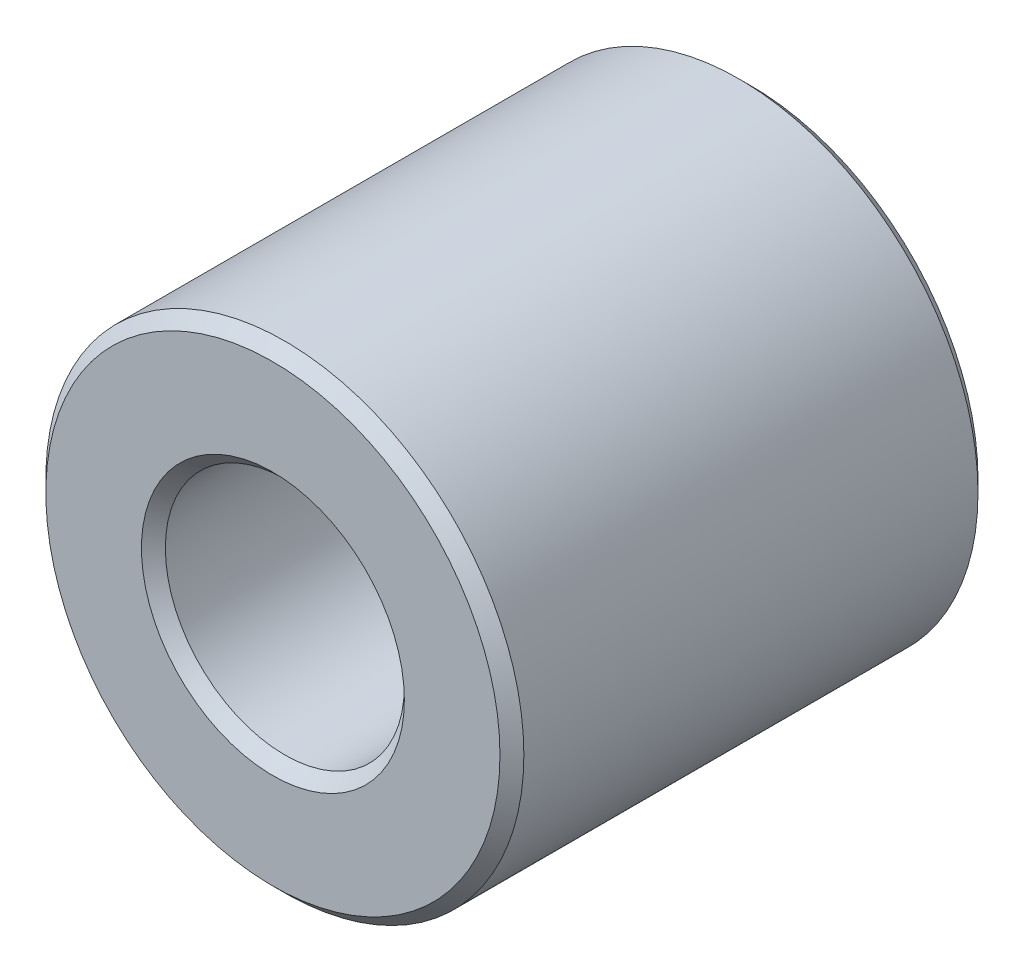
ISO-10303-21;
HEADER;
FILE_DESCRIPTION(('STEP AP214'),'2;1');
FILE_NAME('part.step','',(''),(''),'','','');
FILE_SCHEMA(('AUTOMOTIVE_DESIGN { 1 0 10303 214 1 1 1 1 }'));
ENDSEC;
DATA;
#1=APPLICATION_CONTEXT('core data for automotive mechanical design processes');
#2=APPLICATION_PROTOCOL_DEFINITION('international standard','automotive_design',2000,#1);
#3=PRODUCT_CONTEXT('',#1,'mechanical');
#4=PRODUCT('Part','Part','',(#3));
#5=PRODUCT_RELATED_PRODUCT_CATEGORY('part','',(#4));
#6=PRODUCT_DEFINITION_FORMATION('','',#4);
#7=PRODUCT_DEFINITION_CONTEXT('part definition',#1,'design');
#8=PRODUCT_DEFINITION('design','',#6,#7);
#9=PRODUCT_DEFINITION_SHAPE('','',#8);
#10=(LENGTH_UNIT() NAMED_UNIT(*) SI_UNIT(.MILLI.,.METRE.));
#11=(NAMED_UNIT(*) PLANE_ANGLE_UNIT() SI_UNIT($,.RADIAN.));
#12=(NAMED_UNIT(*) SI_UNIT($,.STERADIAN.) SOLID_ANGLE_UNIT());
#13=UNCERTAINTY_MEASURE_WITH_UNIT(LENGTH_MEASURE(1.E-05),#10,'distance_accuracy_value','');
#14=(GEOMETRIC_REPRESENTATION_CONTEXT(3) GLOBAL_UNCERTAINTY_ASSIGNED_CONTEXT((#13)) GLOBAL_UNIT_ASSIGNED_CONTEXT((#10,
#11,#12)) REPRESENTATION_CONTEXT('',''));
#15=CARTESIAN_POINT('',(0.,0.,0.));
#16=DIRECTION('',(0.,0.,1.));
#17=DIRECTION('',(1.,0.,0.));
#18=AXIS2_PLACEMENT_3D('',#15,#16,#17);
#19=CARTESIAN_POINT('',(0.,0.,40.));
#20=DIRECTION('',(0.,0.,1.));
#21=DIRECTION('',(1.,0.,0.));
#22=AXIS2_PLACEMENT_3D('',#19,#20,#21);
#23=PLANE('',#22);
#24=CARTESIAN_POINT('',(0.,0.,40.));
#25=DIRECTION('',(0.,0.,1.));
#26=DIRECTION('',(1.,0.,0.));
#27=AXIS2_PLACEMENT_3D('',#24,#25,#26);
#28=CIRCLE('',#27,22.);
#29=CARTESIAN_POINT('',(22.,0.,40.));
#30=VERTEX_POINT('',#29);
#31=EDGE_CURVE('E10',#30,#30,#28,.F.);
#32=ORIENTED_EDGE('',*,*,#31,.T.);
#33=EDGE_LOOP('',(#32));
#34=FACE_BOUND('',#33,.T.);
#35=CARTESIAN_POINT('',(0.,0.,40.));
#36=DIRECTION('',(0.,0.,1.));
#37=DIRECTION('',(1.,0.,0.));
#38=AXIS2_PLACEMENT_3D('',#35,#36,#37);
#39=CIRCLE('',#38,38.);
#40=CARTESIAN_POINT('',(38.,0.,40.));
#41=VERTEX_POINT('',#40);
#42=EDGE_CURVE('E45',#41,#41,#39,.T.);
#43=ORIENTED_EDGE('',*,*,#42,.T.);
#44=EDGE_LOOP('',(#43));
#45=FACE_BOUND('',#44,.T.);
#46=ADVANCED_FACE('F37',(#34,#45),#23,.T.);
#47=CARTESIAN_POINT('',(0.,0.,-40.));
#48=DIRECTION('',(0.,0.,1.));
#49=DIRECTION('',(1.,0.,0.));
#50=AXIS2_PLACEMENT_3D('',#47,#48,#49);
#51=PLANE('',#50);
#52=CARTESIAN_POINT('',(0.,0.,-40.));
#53=DIRECTION('',(0.,0.,1.));
#54=DIRECTION('',(1.,0.,0.));
#55=AXIS2_PLACEMENT_3D('',#52,#53,#54);
#56=CIRCLE('',#55,22.);
#57=CARTESIAN_POINT('',(22.,0.,-40.));
#58=VERTEX_POINT('',#57);
#59=EDGE_CURVE('E71',#58,#58,#56,.T.);
#60=ORIENTED_EDGE('',*,*,#59,.T.);
#61=EDGE_LOOP('',(#60));
#62=FACE_BOUND('',#61,.T.);
#63=CARTESIAN_POINT('',(0.,0.,-40.));
#64=DIRECTION('',(0.,0.,1.));
#65=DIRECTION('',(1.,0.,0.));
#66=AXIS2_PLACEMENT_3D('',#63,#64,#65);
#67=CIRCLE('',#66,38.);
#68=CARTESIAN_POINT('',(38.,0.,-40.));
#69=VERTEX_POINT('',#68);
#70=EDGE_CURVE('E74',#69,#69,#67,.F.);
#71=ORIENTED_EDGE('',*,*,#70,.T.);
#72=EDGE_LOOP('',(#71));
#73=FACE_BOUND('',#72,.T.);
#74=ADVANCED_FACE('F78',(#62,#73),#51,.F.);
#75=CARTESIAN_POINT('',(0.,0.,40.));
#76=DIRECTION('',(0.,0.,-1.));
#77=DIRECTION('',(-1.,0.,0.));
#78=AXIS2_PLACEMENT_3D('',#75,#76,#77);
#79=CYLINDRICAL_SURFACE('',#78,40.);
#80=CARTESIAN_POINT('',(0.,0.,-38.));
#81=DIRECTION('',(0.,0.,1.));
#82=DIRECTION('',(1.,0.,0.));
#83=AXIS2_PLACEMENT_3D('',#80,#81,#82);
#84=CIRCLE('',#83,40.);
#85=CARTESIAN_POINT('',(40.,0.,-38.));
#86=VERTEX_POINT('',#85);
#87=EDGE_CURVE('E52',#86,#86,#84,.T.);
#88=ORIENTED_EDGE('',*,*,#87,.T.);
#89=EDGE_LOOP('',(#88));
#90=FACE_BOUND('',#89,.T.);
#91=CARTESIAN_POINT('',(0.,0.,38.));
#92=DIRECTION('',(0.,0.,1.));
#93=DIRECTION('',(1.,0.,0.));
#94=AXIS2_PLACEMENT_3D('',#91,#92,#93);
#95=CIRCLE('',#94,40.);
#96=CARTESIAN_POINT('',(40.,0.,38.));
#97=VERTEX_POINT('',#96);
#98=EDGE_CURVE('E58',#97,#97,#95,.F.);
#99=ORIENTED_EDGE('',*,*,#98,.T.);
#100=EDGE_LOOP('',(#99));
#101=FACE_BOUND('',#100,.T.);
#102=ADVANCED_FACE('F88',(#90,#101),#79,.T.);
#103=CARTESIAN_POINT('',(0.,0.,40.));
#104=DIRECTION('',(0.,0.,-1.));
#105=DIRECTION('',(-1.,0.,0.));
#106=AXIS2_PLACEMENT_3D('',#103,#104,#105);
#107=CYLINDRICAL_SURFACE('',#106,20.);
#108=CARTESIAN_POINT('',(0.,0.,-38.));
#109=DIRECTION('',(0.,0.,1.));
#110=DIRECTION('',(1.,0.,0.));
#111=AXIS2_PLACEMENT_3D('',#108,#109,#110);
#112=CIRCLE('',#111,20.);
#113=CARTESIAN_POINT('',(20.,0.,-38.));
#114=VERTEX_POINT('',#113);
#115=EDGE_CURVE('E64',#114,#114,#112,.F.);
#116=ORIENTED_EDGE('',*,*,#115,.T.);
#117=EDGE_LOOP('',(#116));
#118=FACE_BOUND('',#117,.T.);
#119=CARTESIAN_POINT('',(0.,0.,38.));
#120=DIRECTION('',(0.,0.,1.));
#121=DIRECTION('',(1.,0.,0.));
#122=AXIS2_PLACEMENT_3D('',#119,#120,#121);
#123=CIRCLE('',#122,20.);
#124=CARTESIAN_POINT('',(20.,0.,38.));
#125=VERTEX_POINT('',#124);
#126=EDGE_CURVE('E67',#125,#125,#123,.T.);
#127=ORIENTED_EDGE('',*,*,#126,.T.);
#128=EDGE_LOOP('',(#127));
#129=FACE_BOUND('',#128,.T.);
#130=ADVANCED_FACE('F91',(#118,#129),#107,.F.);
#131=CARTESIAN_POINT('',(0.,0.,-40.));
#132=DIRECTION('',(0.,0.,-1.));
#133=DIRECTION('',(-1.,0.,0.));
#134=AXIS2_PLACEMENT_3D('',#131,#132,#133);
#135=CONICAL_SURFACE('',#134,22.,0.785398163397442);
#136=ORIENTED_EDGE('',*,*,#115,.F.);
#137=EDGE_LOOP('',(#136));
#138=FACE_BOUND('',#137,.T.);
#139=ORIENTED_EDGE('',*,*,#59,.F.);
#140=EDGE_LOOP('',(#139));
#141=FACE_BOUND('',#140,.T.);
#142=ADVANCED_FACE('F84',(#138,#141),#135,.F.);
#143=CARTESIAN_POINT('',(0.,0.,-38.));
#144=DIRECTION('',(0.,0.,1.));
#145=DIRECTION('',(1.,0.,0.));
#146=AXIS2_PLACEMENT_3D('',#143,#144,#145);
#147=CONICAL_SURFACE('',#146,40.,0.785398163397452);
#148=ORIENTED_EDGE('',*,*,#70,.F.);
#149=EDGE_LOOP('',(#148));
#150=FACE_BOUND('',#149,.T.);
#151=ORIENTED_EDGE('',*,*,#87,.F.);
#152=EDGE_LOOP('',(#151));
#153=FACE_BOUND('',#152,.T.);
#154=ADVANCED_FACE('F80',(#150,#153),#147,.T.);
#155=CARTESIAN_POINT('',(0.,0.,38.));
#156=DIRECTION('',(0.,0.,1.));
#157=DIRECTION('',(1.,0.,0.));
#158=AXIS2_PLACEMENT_3D('',#155,#156,#157);
#159=CONICAL_SURFACE('',#158,20.,0.785398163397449);
#160=ORIENTED_EDGE('',*,*,#31,.F.);
#161=EDGE_LOOP('',(#160));
#162=FACE_BOUND('',#161,.T.);
#163=ORIENTED_EDGE('',*,*,#126,.F.);
#164=EDGE_LOOP('',(#163));
#165=FACE_BOUND('',#164,.T.);
#166=ADVANCED_FACE('F83',(#162,#165),#159,.F.);
#167=CARTESIAN_POINT('',(0.,0.,40.));
#168=DIRECTION('',(0.,0.,-1.));
#169=DIRECTION('',(-1.,0.,0.));
#170=AXIS2_PLACEMENT_3D('',#167,#168,#169);
#171=CONICAL_SURFACE('',#170,38.,0.785398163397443);
#172=ORIENTED_EDGE('',*,*,#98,.F.);
#173=EDGE_LOOP('',(#172));
#174=FACE_BOUND('',#173,.T.);
#175=ORIENTED_EDGE('',*,*,#42,.F.);
#176=EDGE_LOOP('',(#175));
#177=FACE_BOUND('',#176,.T.);
#178=ADVANCED_FACE('F39',(#174,#177),#171,.T.);
#179=CLOSED_SHELL('',(#46,#74,#102,#130,#142,#154,#166,#178));
#180=MANIFOLD_SOLID_BREP('B2',#179);
#181=ADVANCED_BREP_SHAPE_REPRESENTATION('',(#18,#180),#14);
#182=SHAPE_DEFINITION_REPRESENTATION(#9,#181);
ENDSEC;
END-ISO-10303-21;
